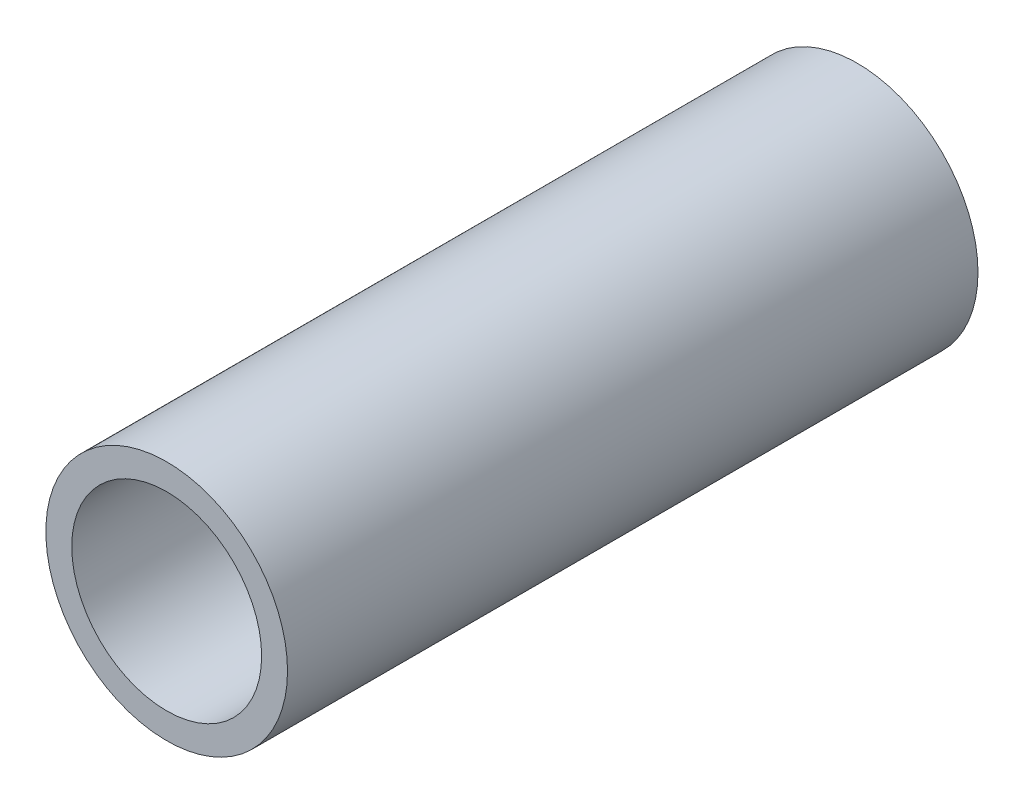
ISO-10303-21;
HEADER;
FILE_DESCRIPTION(('STEP AP214'),'2;1');
FILE_NAME('part.step','',(''),(''),'','','');
FILE_SCHEMA(('AUTOMOTIVE_DESIGN { 1 0 10303 214 1 1 1 1 }'));
ENDSEC;
DATA;
#1=APPLICATION_CONTEXT('core data for automotive mechanical design processes');
#2=APPLICATION_PROTOCOL_DEFINITION('international standard','automotive_design',2000,#1);
#3=PRODUCT_CONTEXT('',#1,'mechanical');
#4=PRODUCT('Part','Part','',(#3));
#5=PRODUCT_RELATED_PRODUCT_CATEGORY('part','',(#4));
#6=PRODUCT_DEFINITION_FORMATION('','',#4);
#7=PRODUCT_DEFINITION_CONTEXT('part definition',#1,'design');
#8=PRODUCT_DEFINITION('design','',#6,#7);
#9=PRODUCT_DEFINITION_SHAPE('','',#8);
#10=(LENGTH_UNIT() NAMED_UNIT(*) SI_UNIT(.MILLI.,.METRE.));
#11=(NAMED_UNIT(*) PLANE_ANGLE_UNIT() SI_UNIT($,.RADIAN.));
#12=(NAMED_UNIT(*) SI_UNIT($,.STERADIAN.) SOLID_ANGLE_UNIT());
#13=UNCERTAINTY_MEASURE_WITH_UNIT(LENGTH_MEASURE(1.E-05),#10,'distance_accuracy_value','');
#14=(GEOMETRIC_REPRESENTATION_CONTEXT(3) GLOBAL_UNCERTAINTY_ASSIGNED_CONTEXT((#13)) GLOBAL_UNIT_ASSIGNED_CONTEXT((#10,
#11,#12)) REPRESENTATION_CONTEXT('',''));
#15=CARTESIAN_POINT('',(0.,0.,0.));
#16=DIRECTION('',(0.,0.,1.));
#17=DIRECTION('',(1.,0.,0.));
#18=AXIS2_PLACEMENT_3D('',#15,#16,#17);
#19=CARTESIAN_POINT('',(0.,0.,80.));
#20=DIRECTION('',(0.,0.,1.));
#21=DIRECTION('',(1.,0.,0.));
#22=AXIS2_PLACEMENT_3D('',#19,#20,#21);
#23=PLANE('',#22);
#24=CARTESIAN_POINT('',(0.,0.,80.));
#25=DIRECTION('',(0.,0.,1.));
#26=DIRECTION('',(1.,0.,0.));
#27=AXIS2_PLACEMENT_3D('',#24,#25,#26);
#28=CIRCLE('',#27,14.);
#29=CARTESIAN_POINT('',(14.,0.,80.));
#30=VERTEX_POINT('',#29);
#31=EDGE_CURVE('E10',#30,#30,#28,.T.);
#32=ORIENTED_EDGE('',*,*,#31,.T.);
#33=EDGE_LOOP('',(#32));
#34=FACE_BOUND('',#33,.T.);
#35=CARTESIAN_POINT('',(0.,0.,80.));
#36=DIRECTION('',(0.,0.,1.));
#37=DIRECTION('',(1.,0.,0.));
#38=AXIS2_PLACEMENT_3D('',#35,#36,#37);
#39=CIRCLE('',#38,11.);
#40=CARTESIAN_POINT('',(11.,0.,80.));
#41=VERTEX_POINT('',#40);
#42=EDGE_CURVE('E40',#41,#41,#39,.T.);
#43=ORIENTED_EDGE('',*,*,#42,.F.);
#44=EDGE_LOOP('',(#43));
#45=FACE_BOUND('',#44,.T.);
#46=ADVANCED_FACE('F29',(#34,#45),#23,.T.);
#47=CARTESIAN_POINT('',(0.,0.,0.));
#48=DIRECTION('',(0.,0.,1.));
#49=DIRECTION('',(1.,0.,0.));
#50=AXIS2_PLACEMENT_3D('',#47,#48,#49);
#51=PLANE('',#50);
#52=CARTESIAN_POINT('',(0.,0.,0.));
#53=DIRECTION('',(0.,0.,1.));
#54=DIRECTION('',(1.,0.,0.));
#55=AXIS2_PLACEMENT_3D('',#52,#53,#54);
#56=CIRCLE('',#55,14.);
#57=CARTESIAN_POINT('',(14.,0.,0.));
#58=VERTEX_POINT('',#57);
#59=EDGE_CURVE('E36',#58,#58,#56,.T.);
#60=ORIENTED_EDGE('',*,*,#59,.F.);
#61=EDGE_LOOP('',(#60));
#62=FACE_BOUND('',#61,.T.);
#63=CARTESIAN_POINT('',(0.,0.,0.));
#64=DIRECTION('',(0.,0.,1.));
#65=DIRECTION('',(1.,0.,0.));
#66=AXIS2_PLACEMENT_3D('',#63,#64,#65);
#67=CIRCLE('',#66,11.);
#68=CARTESIAN_POINT('',(11.,0.,0.));
#69=VERTEX_POINT('',#68);
#70=EDGE_CURVE('E44',#69,#69,#67,.T.);
#71=ORIENTED_EDGE('',*,*,#70,.T.);
#72=EDGE_LOOP('',(#71));
#73=FACE_BOUND('',#72,.T.);
#74=ADVANCED_FACE('F50',(#62,#73),#51,.F.);
#75=CARTESIAN_POINT('',(0.,0.,80.));
#76=DIRECTION('',(0.,0.,-1.));
#77=DIRECTION('',(-1.,0.,0.));
#78=AXIS2_PLACEMENT_3D('',#75,#76,#77);
#79=CYLINDRICAL_SURFACE('',#78,14.);
#80=ORIENTED_EDGE('',*,*,#31,.F.);
#81=EDGE_LOOP('',(#80));
#82=FACE_BOUND('',#81,.T.);
#83=ORIENTED_EDGE('',*,*,#59,.T.);
#84=EDGE_LOOP('',(#83));
#85=FACE_BOUND('',#84,.T.);
#86=ADVANCED_FACE('F31',(#82,#85),#79,.T.);
#87=CARTESIAN_POINT('',(0.,0.,80.));
#88=DIRECTION('',(0.,0.,-1.));
#89=DIRECTION('',(-1.,0.,0.));
#90=AXIS2_PLACEMENT_3D('',#87,#88,#89);
#91=CYLINDRICAL_SURFACE('',#90,11.);
#92=ORIENTED_EDGE('',*,*,#42,.T.);
#93=EDGE_LOOP('',(#92));
#94=FACE_BOUND('',#93,.T.);
#95=ORIENTED_EDGE('',*,*,#70,.F.);
#96=EDGE_LOOP('',(#95));
#97=FACE_BOUND('',#96,.T.);
#98=ADVANCED_FACE('F52',(#94,#97),#91,.F.);
#99=CLOSED_SHELL('',(#46,#74,#86,#98));
#100=MANIFOLD_SOLID_BREP('B2',#99);
#101=ADVANCED_BREP_SHAPE_REPRESENTATION('',(#18,#100),#14);
#102=SHAPE_DEFINITION_REPRESENTATION(#9,#101);
ENDSEC;
END-ISO-10303-21;
